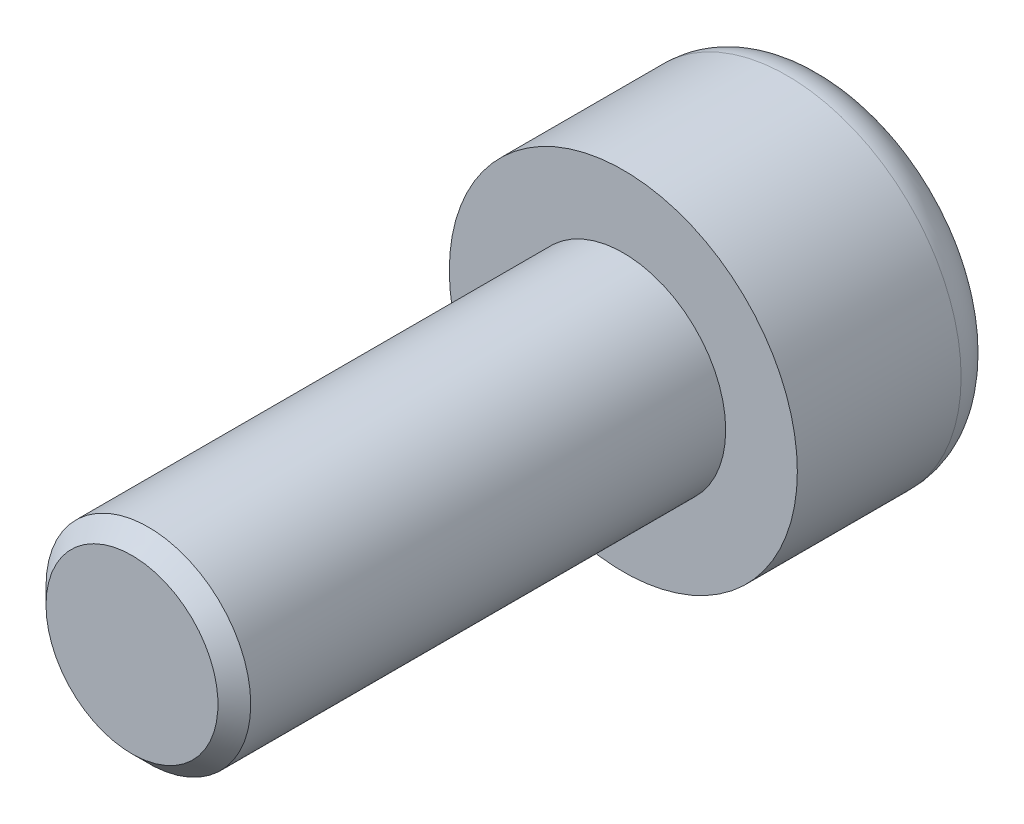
ISO-10303-21;
HEADER;
FILE_DESCRIPTION(('STEP AP214'),'2;1');
FILE_NAME('part.step','',(''),(''),'','','');
FILE_SCHEMA(('AUTOMOTIVE_DESIGN { 1 0 10303 214 1 1 1 1 }'));
ENDSEC;
DATA;
#1=APPLICATION_CONTEXT('core data for automotive mechanical design processes');
#2=APPLICATION_PROTOCOL_DEFINITION('international standard','automotive_design',2000,#1);
#3=PRODUCT_CONTEXT('',#1,'mechanical');
#4=PRODUCT('Part','Part','',(#3));
#5=PRODUCT_RELATED_PRODUCT_CATEGORY('part','',(#4));
#6=PRODUCT_DEFINITION_FORMATION('','',#4);
#7=PRODUCT_DEFINITION_CONTEXT('part definition',#1,'design');
#8=PRODUCT_DEFINITION('design','',#6,#7);
#9=PRODUCT_DEFINITION_SHAPE('','',#8);
#10=(LENGTH_UNIT() NAMED_UNIT(*) SI_UNIT(.MILLI.,.METRE.));
#11=(NAMED_UNIT(*) PLANE_ANGLE_UNIT() SI_UNIT($,.RADIAN.));
#12=(NAMED_UNIT(*) SI_UNIT($,.STERADIAN.) SOLID_ANGLE_UNIT());
#13=UNCERTAINTY_MEASURE_WITH_UNIT(LENGTH_MEASURE(1.E-05),#10,'distance_accuracy_value','');
#14=(GEOMETRIC_REPRESENTATION_CONTEXT(3) GLOBAL_UNCERTAINTY_ASSIGNED_CONTEXT((#13)) GLOBAL_UNIT_ASSIGNED_CONTEXT((#10,
#11,#12)) REPRESENTATION_CONTEXT('',''));
#15=CARTESIAN_POINT('',(0.,0.,0.));
#16=DIRECTION('',(0.,0.,1.));
#17=DIRECTION('',(1.,0.,0.));
#18=AXIS2_PLACEMENT_3D('',#15,#16,#17);
#19=CARTESIAN_POINT('',(-3.99999999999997,0.,3.125));
#20=DIRECTION('',(0.,0.,1.));
#21=DIRECTION('',(1.,0.,0.));
#22=AXIS2_PLACEMENT_3D('',#19,#20,#21);
#23=PLANE('',#22);
#24=DIRECTION('',(-0.866025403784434,0.500000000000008,0.));
#25=VECTOR('',#24,1.);
#26=CARTESIAN_POINT('',(0.,2.30940107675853,3.125));
#27=LINE('',#26,#25);
#28=CARTESIAN_POINT('',(0.,2.30940107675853,3.125));
#29=VERTEX_POINT('',#28);
#30=CARTESIAN_POINT('',(2.,1.15470053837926,3.125));
#31=VERTEX_POINT('',#30);
#32=EDGE_CURVE('E65',#29,#31,#27,.F.);
#33=ORIENTED_EDGE('',*,*,#32,.T.);
#34=DIRECTION('',(0.,1.,0.));
#35=VECTOR('',#34,1.);
#36=CARTESIAN_POINT('',(2.,1.15470053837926,3.125));
#37=LINE('',#36,#35);
#38=CARTESIAN_POINT('',(2.,-1.15470053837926,3.125));
#39=VERTEX_POINT('',#38);
#40=EDGE_CURVE('E62',#31,#39,#37,.F.);
#41=ORIENTED_EDGE('',*,*,#40,.T.);
#42=DIRECTION('',(0.866025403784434,0.500000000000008,0.));
#43=VECTOR('',#42,1.);
#44=CARTESIAN_POINT('',(2.,-1.15470053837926,3.125));
#45=LINE('',#44,#43);
#46=CARTESIAN_POINT('',(0.,-2.30940107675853,3.125));
#47=VERTEX_POINT('',#46);
#48=EDGE_CURVE('E59',#39,#47,#45,.F.);
#49=ORIENTED_EDGE('',*,*,#48,.T.);
#50=DIRECTION('',(0.866025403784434,-0.500000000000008,0.));
#51=VECTOR('',#50,1.);
#52=CARTESIAN_POINT('',(-2.,-1.15470053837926,3.125));
#53=LINE('',#52,#51);
#54=CARTESIAN_POINT('',(-2.,-1.15470053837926,3.125));
#55=VERTEX_POINT('',#54);
#56=EDGE_CURVE('E86',#47,#55,#53,.F.);
#57=ORIENTED_EDGE('',*,*,#56,.T.);
#58=DIRECTION('',(0.,1.,0.));
#59=VECTOR('',#58,1.);
#60=CARTESIAN_POINT('',(-2.,1.15470053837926,3.125));
#61=LINE('',#60,#59);
#62=CARTESIAN_POINT('',(-2.,1.15470053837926,3.125));
#63=VERTEX_POINT('',#62);
#64=EDGE_CURVE('E284',#55,#63,#61,.T.);
#65=ORIENTED_EDGE('',*,*,#64,.T.);
#66=DIRECTION('',(-0.866025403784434,-0.500000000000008,0.));
#67=VECTOR('',#66,1.);
#68=CARTESIAN_POINT('',(0.,2.30940107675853,3.125));
#69=LINE('',#68,#67);
#70=EDGE_CURVE('E291',#63,#29,#69,.F.);
#71=ORIENTED_EDGE('',*,*,#70,.T.);
#72=EDGE_LOOP('',(#33,#41,#49,#57,#65,#71));
#73=FACE_BOUND('',#72,.T.);
#74=ADVANCED_FACE('F16',(#73),#23,.F.);
#75=CARTESIAN_POINT('',(2.,1.15470053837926,3.125));
#76=DIRECTION('',(1.,0.,0.));
#77=DIRECTION('',(0.,0.,-1.));
#78=AXIS2_PLACEMENT_3D('',#75,#76,#77);
#79=PLANE('',#78);
#80=DIRECTION('',(0.,0.,1.));
#81=VECTOR('',#80,1.);
#82=CARTESIAN_POINT('',(2.,-1.15470053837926,3.125));
#83=LINE('',#82,#81);
#84=CARTESIAN_POINT('',(2.,-1.15470053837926,0.));
#85=VERTEX_POINT('',#84);
#86=EDGE_CURVE('E69',#85,#39,#83,.T.);
#87=ORIENTED_EDGE('',*,*,#86,.T.);
#88=ORIENTED_EDGE('',*,*,#40,.F.);
#89=DIRECTION('',(0.,0.,1.));
#90=VECTOR('',#89,1.);
#91=CARTESIAN_POINT('',(2.,1.15470053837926,3.125));
#92=LINE('',#91,#90);
#93=CARTESIAN_POINT('',(2.,1.15470053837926,0.));
#94=VERTEX_POINT('',#93);
#95=EDGE_CURVE('E122',#31,#94,#92,.F.);
#96=ORIENTED_EDGE('',*,*,#95,.T.);
#97=DIRECTION('',(0.,1.,0.));
#98=VECTOR('',#97,1.);
#99=CARTESIAN_POINT('',(2.,0.,0.));
#100=LINE('',#99,#98);
#101=EDGE_CURVE('E76',#94,#85,#100,.F.);
#102=ORIENTED_EDGE('',*,*,#101,.T.);
#103=EDGE_LOOP('',(#87,#88,#96,#102));
#104=FACE_BOUND('',#103,.T.);
#105=ADVANCED_FACE('F73',(#104),#79,.F.);
#106=CARTESIAN_POINT('',(2.,-1.15470053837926,3.125));
#107=DIRECTION('',(0.500000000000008,-0.866025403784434,0.));
#108=DIRECTION('',(0.866025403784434,0.500000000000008,0.));
#109=AXIS2_PLACEMENT_3D('',#106,#107,#108);
#110=PLANE('',#109);
#111=DIRECTION('',(0.,0.,1.));
#112=VECTOR('',#111,1.);
#113=CARTESIAN_POINT('',(0.,-2.30940107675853,3.125));
#114=LINE('',#113,#112);
#115=CARTESIAN_POINT('',(0.,-2.30940107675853,0.));
#116=VERTEX_POINT('',#115);
#117=EDGE_CURVE('E83',#116,#47,#114,.T.);
#118=ORIENTED_EDGE('',*,*,#117,.T.);
#119=ORIENTED_EDGE('',*,*,#48,.F.);
#120=ORIENTED_EDGE('',*,*,#86,.F.);
#121=DIRECTION('',(-0.866025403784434,-0.500000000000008,0.));
#122=VECTOR('',#121,1.);
#123=CARTESIAN_POINT('',(2.,-1.15470053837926,0.));
#124=LINE('',#123,#122);
#125=EDGE_CURVE('E120',#85,#116,#124,.T.);
#126=ORIENTED_EDGE('',*,*,#125,.T.);
#127=EDGE_LOOP('',(#118,#119,#120,#126));
#128=FACE_BOUND('',#127,.T.);
#129=ADVANCED_FACE('F81',(#128),#110,.F.);
#130=CARTESIAN_POINT('',(-2.,-1.15470053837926,3.125));
#131=DIRECTION('',(-0.500000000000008,-0.866025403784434,0.));
#132=DIRECTION('',(0.866025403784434,-0.500000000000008,0.));
#133=AXIS2_PLACEMENT_3D('',#130,#131,#132);
#134=PLANE('',#133);
#135=DIRECTION('',(0.,0.,1.));
#136=VECTOR('',#135,1.);
#137=CARTESIAN_POINT('',(-2.,-1.15470053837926,3.125));
#138=LINE('',#137,#136);
#139=CARTESIAN_POINT('',(-2.,-1.15470053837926,0.));
#140=VERTEX_POINT('',#139);
#141=EDGE_CURVE('E279',#140,#55,#138,.T.);
#142=ORIENTED_EDGE('',*,*,#141,.T.);
#143=ORIENTED_EDGE('',*,*,#56,.F.);
#144=ORIENTED_EDGE('',*,*,#117,.F.);
#145=DIRECTION('',(-0.866025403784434,0.500000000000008,0.));
#146=VECTOR('',#145,1.);
#147=CARTESIAN_POINT('',(0.,-2.30940107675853,0.));
#148=LINE('',#147,#146);
#149=EDGE_CURVE('E117',#116,#140,#148,.T.);
#150=ORIENTED_EDGE('',*,*,#149,.T.);
#151=EDGE_LOOP('',(#142,#143,#144,#150));
#152=FACE_BOUND('',#151,.T.);
#153=ADVANCED_FACE('F234',(#152),#134,.F.);
#154=CARTESIAN_POINT('',(-2.,1.15470053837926,3.125));
#155=DIRECTION('',(-1.,0.,0.));
#156=DIRECTION('',(0.,0.,1.));
#157=AXIS2_PLACEMENT_3D('',#154,#155,#156);
#158=PLANE('',#157);
#159=DIRECTION('',(0.,0.,1.));
#160=VECTOR('',#159,1.);
#161=CARTESIAN_POINT('',(-2.,1.15470053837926,3.125));
#162=LINE('',#161,#160);
#163=CARTESIAN_POINT('',(-2.,1.15470053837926,0.));
#164=VERTEX_POINT('',#163);
#165=EDGE_CURVE('E288',#164,#63,#162,.T.);
#166=ORIENTED_EDGE('',*,*,#165,.T.);
#167=ORIENTED_EDGE('',*,*,#64,.F.);
#168=ORIENTED_EDGE('',*,*,#141,.F.);
#169=DIRECTION('',(0.,1.,0.));
#170=VECTOR('',#169,1.);
#171=CARTESIAN_POINT('',(-2.,0.,0.));
#172=LINE('',#171,#170);
#173=EDGE_CURVE('E108',#140,#164,#172,.T.);
#174=ORIENTED_EDGE('',*,*,#173,.T.);
#175=EDGE_LOOP('',(#166,#167,#168,#174));
#176=FACE_BOUND('',#175,.T.);
#177=ADVANCED_FACE('F224',(#176),#158,.F.);
#178=CARTESIAN_POINT('',(0.,2.30940107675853,3.125));
#179=DIRECTION('',(-0.500000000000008,0.866025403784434,0.));
#180=DIRECTION('',(-0.866025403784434,-0.500000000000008,0.));
#181=AXIS2_PLACEMENT_3D('',#178,#179,#180);
#182=PLANE('',#181);
#183=DIRECTION('',(0.,0.,1.));
#184=VECTOR('',#183,1.);
#185=CARTESIAN_POINT('',(0.,2.30940107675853,3.125));
#186=LINE('',#185,#184);
#187=CARTESIAN_POINT('',(0.,2.30940107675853,0.));
#188=VERTEX_POINT('',#187);
#189=EDGE_CURVE('E295',#188,#29,#186,.T.);
#190=ORIENTED_EDGE('',*,*,#189,.T.);
#191=ORIENTED_EDGE('',*,*,#70,.F.);
#192=ORIENTED_EDGE('',*,*,#165,.F.);
#193=DIRECTION('',(0.866025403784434,0.500000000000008,0.));
#194=VECTOR('',#193,1.);
#195=CARTESIAN_POINT('',(-2.,1.15470053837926,0.));
#196=LINE('',#195,#194);
#197=EDGE_CURVE('E102',#164,#188,#196,.T.);
#198=ORIENTED_EDGE('',*,*,#197,.T.);
#199=EDGE_LOOP('',(#190,#191,#192,#198));
#200=FACE_BOUND('',#199,.T.);
#201=ADVANCED_FACE('F163',(#200),#182,.F.);
#202=CARTESIAN_POINT('',(0.,2.30940107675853,3.125));
#203=DIRECTION('',(0.500000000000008,0.866025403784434,0.));
#204=DIRECTION('',(-0.866025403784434,0.500000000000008,0.));
#205=AXIS2_PLACEMENT_3D('',#202,#203,#204);
#206=PLANE('',#205);
#207=ORIENTED_EDGE('',*,*,#95,.F.);
#208=ORIENTED_EDGE('',*,*,#32,.F.);
#209=ORIENTED_EDGE('',*,*,#189,.F.);
#210=DIRECTION('',(0.866025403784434,-0.500000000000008,0.));
#211=VECTOR('',#210,1.);
#212=CARTESIAN_POINT('',(0.,2.30940107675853,0.));
#213=LINE('',#212,#211);
#214=EDGE_CURVE('E100',#188,#94,#213,.T.);
#215=ORIENTED_EDGE('',*,*,#214,.T.);
#216=EDGE_LOOP('',(#207,#208,#209,#215));
#217=FACE_BOUND('',#216,.T.);
#218=ADVANCED_FACE('F157',(#217),#206,.F.);
#219=CARTESIAN_POINT('',(0.,0.,0.));
#220=DIRECTION('',(0.,0.,1.));
#221=DIRECTION('',(1.,0.,0.));
#222=AXIS2_PLACEMENT_3D('',#219,#220,#221);
#223=PLANE('',#222);
#224=ORIENTED_EDGE('',*,*,#197,.F.);
#225=ORIENTED_EDGE('',*,*,#173,.F.);
#226=ORIENTED_EDGE('',*,*,#149,.F.);
#227=ORIENTED_EDGE('',*,*,#125,.F.);
#228=ORIENTED_EDGE('',*,*,#101,.F.);
#229=ORIENTED_EDGE('',*,*,#214,.F.);
#230=EDGE_LOOP('',(#224,#225,#226,#227,#228,#229));
#231=FACE_BOUND('',#230,.T.);
#232=CARTESIAN_POINT('',(0.,0.,0.));
#233=DIRECTION('',(0.,0.,1.));
#234=DIRECTION('',(1.,0.,0.));
#235=AXIS2_PLACEMENT_3D('',#232,#233,#234);
#236=CIRCLE('',#235,3.25);
#237=CARTESIAN_POINT('',(3.25,0.,0.));
#238=VERTEX_POINT('',#237);
#239=CARTESIAN_POINT('',(-3.25,0.,0.));
#240=VERTEX_POINT('',#239);
#241=EDGE_CURVE('E98',#238,#240,#236,.T.);
#242=ORIENTED_EDGE('',*,*,#241,.F.);
#243=CARTESIAN_POINT('',(0.,0.,0.));
#244=DIRECTION('',(0.,0.,1.));
#245=DIRECTION('',(-1.,0.,0.));
#246=AXIS2_PLACEMENT_3D('',#243,#244,#245);
#247=CIRCLE('',#246,3.25);
#248=EDGE_CURVE('E35',#240,#238,#247,.T.);
#249=ORIENTED_EDGE('',*,*,#248,.F.);
#250=EDGE_LOOP('',(#242,#249));
#251=FACE_BOUND('',#250,.T.);
#252=ADVANCED_FACE('F138',(#231,#251),#223,.F.);
#253=CARTESIAN_POINT('',(0.,0.,1.));
#254=DIRECTION('',(0.,0.,1.));
#255=DIRECTION('',(1.,0.,0.));
#256=AXIS2_PLACEMENT_3D('',#253,#254,#255);
#257=TOROIDAL_SURFACE('',#256,3.25,1.);
#258=CARTESIAN_POINT('',(0.,0.,1.));
#259=DIRECTION('',(0.,0.,-1.));
#260=DIRECTION('',(-1.,0.,0.));
#261=AXIS2_PLACEMENT_3D('',#258,#259,#260);
#262=CIRCLE('',#261,4.25);
#263=CARTESIAN_POINT('',(-4.25,0.,1.));
#264=VERTEX_POINT('',#263);
#265=EDGE_CURVE('E95',#264,#264,#262,.F.);
#266=ORIENTED_EDGE('',*,*,#265,.F.);
#267=EDGE_LOOP('',(#266));
#268=FACE_BOUND('',#267,.T.);
#269=ORIENTED_EDGE('',*,*,#241,.T.);
#270=ORIENTED_EDGE('',*,*,#248,.T.);
#271=EDGE_LOOP('',(#269,#270));
#272=FACE_BOUND('',#271,.T.);
#273=ADVANCED_FACE('F97',(#268,#272),#257,.T.);
#274=CARTESIAN_POINT('',(0.,0.,17.));
#275=DIRECTION('',(0.,0.,1.));
#276=DIRECTION('',(1.,0.,0.));
#277=AXIS2_PLACEMENT_3D('',#274,#275,#276);
#278=PLANE('',#277);
#279=CARTESIAN_POINT('',(0.,0.,16.9999999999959));
#280=DIRECTION('',(0.,0.,-1.));
#281=DIRECTION('',(-1.,0.,0.));
#282=AXIS2_PLACEMENT_3D('',#279,#280,#281);
#283=CIRCLE('',#282,2.09999999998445);
#284=CARTESIAN_POINT('',(-2.09999999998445,0.,16.9999999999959));
#285=VERTEX_POINT('',#284);
#286=EDGE_CURVE('E93',#285,#285,#283,.T.);
#287=ORIENTED_EDGE('',*,*,#286,.F.);
#288=EDGE_LOOP('',(#287));
#289=FACE_BOUND('',#288,.T.);
#290=ADVANCED_FACE('F137',(#289),#278,.T.);
#291=CARTESIAN_POINT('',(0.,0.,5.));
#292=DIRECTION('',(0.,0.,-1.));
#293=DIRECTION('',(-1.,0.,0.));
#294=AXIS2_PLACEMENT_3D('',#291,#292,#293);
#295=CYLINDRICAL_SURFACE('',#294,4.25);
#296=ORIENTED_EDGE('',*,*,#265,.T.);
#297=EDGE_LOOP('',(#296));
#298=FACE_BOUND('',#297,.T.);
#299=CARTESIAN_POINT('',(0.,0.,5.));
#300=DIRECTION('',(0.,0.,-1.));
#301=DIRECTION('',(-1.,0.,0.));
#302=AXIS2_PLACEMENT_3D('',#299,#300,#301);
#303=CIRCLE('',#302,4.25);
#304=CARTESIAN_POINT('',(-4.25,0.,5.));
#305=VERTEX_POINT('',#304);
#306=EDGE_CURVE('E90',#305,#305,#303,.F.);
#307=ORIENTED_EDGE('',*,*,#306,.F.);
#308=EDGE_LOOP('',(#307));
#309=FACE_BOUND('',#308,.T.);
#310=ADVANCED_FACE('F179',(#298,#309),#295,.T.);
#311=CARTESIAN_POINT('',(0.,0.,16.5999999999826));
#312=DIRECTION('',(0.,0.,-1.));
#313=DIRECTION('',(-1.,0.,0.));
#314=AXIS2_PLACEMENT_3D('',#311,#312,#313);
#315=CONICAL_SURFACE('',#314,2.49999999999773,0.785398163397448);
#316=CARTESIAN_POINT('',(0.,0.,16.6));
#317=DIRECTION('',(0.,0.,-1.));
#318=DIRECTION('',(-1.,0.,0.));
#319=AXIS2_PLACEMENT_3D('',#316,#317,#318);
#320=CIRCLE('',#319,2.5);
#321=CARTESIAN_POINT('',(-2.5,0.,16.6));
#322=VERTEX_POINT('',#321);
#323=EDGE_CURVE('E27',#322,#322,#320,.T.);
#324=ORIENTED_EDGE('',*,*,#323,.F.);
#325=EDGE_LOOP('',(#324));
#326=FACE_BOUND('',#325,.T.);
#327=ORIENTED_EDGE('',*,*,#286,.T.);
#328=EDGE_LOOP('',(#327));
#329=FACE_BOUND('',#328,.T.);
#330=ADVANCED_FACE('F173',(#326,#329),#315,.T.);
#331=CARTESIAN_POINT('',(0.,0.,5.));
#332=DIRECTION('',(0.,0.,1.));
#333=DIRECTION('',(1.,0.,0.));
#334=AXIS2_PLACEMENT_3D('',#331,#332,#333);
#335=PLANE('',#334);
#336=CARTESIAN_POINT('',(0.,0.,5.));
#337=DIRECTION('',(0.,0.,-1.));
#338=DIRECTION('',(-1.,0.,0.));
#339=AXIS2_PLACEMENT_3D('',#336,#337,#338);
#340=CIRCLE('',#339,2.5);
#341=CARTESIAN_POINT('',(-2.5,0.,5.));
#342=VERTEX_POINT('',#341);
#343=EDGE_CURVE('E11',#342,#342,#340,.F.);
#344=ORIENTED_EDGE('',*,*,#343,.F.);
#345=EDGE_LOOP('',(#344));
#346=FACE_BOUND('',#345,.T.);
#347=ORIENTED_EDGE('',*,*,#306,.T.);
#348=EDGE_LOOP('',(#347));
#349=FACE_BOUND('',#348,.T.);
#350=ADVANCED_FACE('F167',(#346,#349),#335,.T.);
#351=CARTESIAN_POINT('',(0.,0.,17.));
#352=DIRECTION('',(0.,0.,-1.));
#353=DIRECTION('',(-1.,0.,0.));
#354=AXIS2_PLACEMENT_3D('',#351,#352,#353);
#355=CYLINDRICAL_SURFACE('',#354,2.5);
#356=ORIENTED_EDGE('',*,*,#343,.T.);
#357=EDGE_LOOP('',(#356));
#358=FACE_BOUND('',#357,.T.);
#359=ORIENTED_EDGE('',*,*,#323,.T.);
#360=EDGE_LOOP('',(#359));
#361=FACE_BOUND('',#360,.T.);
#362=ADVANCED_FACE('F165',(#358,#361),#355,.T.);
#363=CLOSED_SHELL('',(#74,#105,#129,#153,#177,#201,#218,#252,#273,#290,#310,#330,#350,#362));
#364=MANIFOLD_SOLID_BREP('B1',#363);
#365=ADVANCED_BREP_SHAPE_REPRESENTATION('',(#18,#364),#14);
#366=SHAPE_DEFINITION_REPRESENTATION(#9,#365);
ENDSEC;
END-ISO-10303-21;
